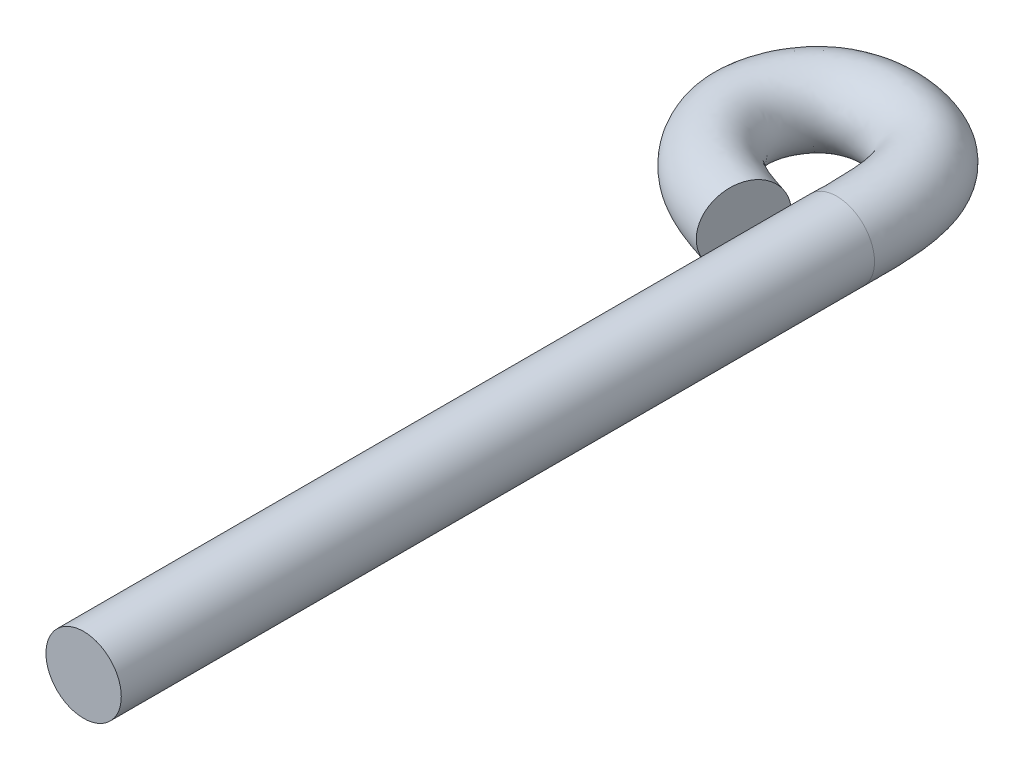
ISO-10303-21;
HEADER;
FILE_DESCRIPTION(('STEP AP214'),'2;1');
FILE_NAME('part.step','',(''),(''),'','','');
FILE_SCHEMA(('AUTOMOTIVE_DESIGN { 1 0 10303 214 1 1 1 1 }'));
ENDSEC;
DATA;
#1=APPLICATION_CONTEXT('core data for automotive mechanical design processes');
#2=APPLICATION_PROTOCOL_DEFINITION('international standard','automotive_design',2000,#1);
#3=PRODUCT_CONTEXT('',#1,'mechanical');
#4=PRODUCT('Part','Part','',(#3));
#5=PRODUCT_RELATED_PRODUCT_CATEGORY('part','',(#4));
#6=PRODUCT_DEFINITION_FORMATION('','',#4);
#7=PRODUCT_DEFINITION_CONTEXT('part definition',#1,'design');
#8=PRODUCT_DEFINITION('design','',#6,#7);
#9=PRODUCT_DEFINITION_SHAPE('','',#8);
#10=(LENGTH_UNIT() NAMED_UNIT(*) SI_UNIT(.MILLI.,.METRE.));
#11=(NAMED_UNIT(*) PLANE_ANGLE_UNIT() SI_UNIT($,.RADIAN.));
#12=(NAMED_UNIT(*) SI_UNIT($,.STERADIAN.) SOLID_ANGLE_UNIT());
#13=UNCERTAINTY_MEASURE_WITH_UNIT(LENGTH_MEASURE(1.E-05),#10,'distance_accuracy_value','');
#14=(GEOMETRIC_REPRESENTATION_CONTEXT(3) GLOBAL_UNCERTAINTY_ASSIGNED_CONTEXT((#13)) GLOBAL_UNIT_ASSIGNED_CONTEXT((#10,
#11,#12)) REPRESENTATION_CONTEXT('',''));
#15=CARTESIAN_POINT('',(0.,0.,0.));
#16=DIRECTION('',(0.,0.,1.));
#17=DIRECTION('',(1.,0.,0.));
#18=AXIS2_PLACEMENT_3D('',#15,#16,#17);
#19=CARTESIAN_POINT('',(0.,0.,0.));
#20=DIRECTION('',(0.,0.,1.));
#21=DIRECTION('',(1.,0.,0.));
#22=AXIS2_PLACEMENT_3D('',#19,#20,#21);
#23=PLANE('',#22);
#24=CARTESIAN_POINT('',(0.,0.,0.));
#25=DIRECTION('',(0.,0.,1.));
#26=DIRECTION('',(1.,0.,0.));
#27=AXIS2_PLACEMENT_3D('',#24,#25,#26);
#28=CIRCLE('',#27,1.1);
#29=CARTESIAN_POINT('',(1.1,0.,0.));
#30=VERTEX_POINT('',#29);
#31=EDGE_CURVE('E10',#30,#30,#28,.T.);
#32=ORIENTED_EDGE('',*,*,#31,.T.);
#33=EDGE_LOOP('',(#32));
#34=FACE_BOUND('',#33,.T.);
#35=ADVANCED_FACE('F360',(#34),#23,.T.);
#36=CARTESIAN_POINT('',(0.,0.,-25.1112698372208));
#37=DIRECTION('',(0.,0.,1.));
#38=DIRECTION('',(1.,0.,0.));
#39=AXIS2_PLACEMENT_3D('',#36,#37,#38);
#40=CYLINDRICAL_SURFACE('',#39,1.1);
#41=ORIENTED_EDGE('',*,*,#31,.F.);
#42=EDGE_LOOP('',(#41));
#43=FACE_BOUND('',#42,.T.);
#44=CARTESIAN_POINT('',(1.1,0.,-21.9939017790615));
#45=CARTESIAN_POINT('',(1.1,2.2,-21.9939017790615));
#46=CARTESIAN_POINT('',(-1.1,2.2,-22.0060982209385));
#47=CARTESIAN_POINT('',(-1.1,0.,-22.0060982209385));
#48=CARTESIAN_POINT('',(-1.1,-2.2,-22.0060982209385));
#49=CARTESIAN_POINT('',(1.1,-2.2,-21.9939017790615));
#50=CARTESIAN_POINT('',(1.1,0.,-21.9939017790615));
#51=(BOUNDED_CURVE() B_SPLINE_CURVE(3,(#44,#45,#46,#47,#48,#49,#50),.UNSPECIFIED.,.T.,
.F.) B_SPLINE_CURVE_WITH_KNOTS((4,3,4),(0.,0.5,1.),
.UNSPECIFIED.) CURVE() GEOMETRIC_REPRESENTATION_ITEM() RATIONAL_B_SPLINE_CURVE((1.,
0.333333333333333,0.333333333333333,1.,0.333333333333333,0.333333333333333,1.)) REPRESENTATION_ITEM(''));
#52=CARTESIAN_POINT('',(1.1,0.,-21.9939017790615));
#53=VERTEX_POINT('',#52);
#54=EDGE_CURVE('E371',#53,#53,#51,.T.);
#55=ORIENTED_EDGE('',*,*,#54,.T.);
#56=EDGE_LOOP('',(#55));
#57=FACE_BOUND('',#56,.T.);
#58=ADVANCED_FACE('F362',(#43,#57),#40,.T.);
#59=CARTESIAN_POINT('',(-1.39315186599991,0.,-22.055074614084));
#60=DIRECTION('',(0.951083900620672,0.,0.308932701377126));
#61=DIRECTION('',(0.308932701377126,0.,-0.951083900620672));
#62=AXIS2_PLACEMENT_3D('',#59,#60,#61);
#63=PLANE('',#62);
#64=CARTESIAN_POINT('',(-1.73297783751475,0.,-21.0088823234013));
#65=DIRECTION('',(0.951083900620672,0.,0.308932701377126));
#66=DIRECTION('',(0.308932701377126,0.,-0.951083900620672));
#67=AXIS2_PLACEMENT_3D('',#64,#65,#66);
#68=CIRCLE('',#67,1.1);
#69=CARTESIAN_POINT('',(-1.39315186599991,0.,-22.055074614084));
#70=VERTEX_POINT('',#69);
#71=EDGE_CURVE('E367',#70,#70,#68,.T.);
#72=ORIENTED_EDGE('',*,*,#71,.T.);
#73=EDGE_LOOP('',(#72));
#74=FACE_BOUND('',#73,.T.);
#75=ADVANCED_FACE('F387',(#74),#63,.T.);
#76=CARTESIAN_POINT('',(1.1,0.,-21.9939017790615));
#77=CARTESIAN_POINT('',(1.10248040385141,0.,-22.2176031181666));
#78=CARTESIAN_POINT('',(1.10758000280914,0.,-22.6667240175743));
#79=CARTESIAN_POINT('',(1.09071506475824,0.,-23.3772602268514));
#80=CARTESIAN_POINT('',(1.03318346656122,0.,-23.9519260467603));
#81=CARTESIAN_POINT('',(0.951777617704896,0.,-24.3708177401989));
#82=CARTESIAN_POINT('',(0.889286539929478,0.,-24.6204636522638));
#83=CARTESIAN_POINT('',(0.810087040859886,0.,-24.8705830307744));
#84=CARTESIAN_POINT('',(0.711243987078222,0.,-25.1201038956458));
#85=CARTESIAN_POINT('',(0.589726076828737,0.,-25.3671839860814));
#86=CARTESIAN_POINT('',(0.442711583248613,0.,-25.6089413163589));
#87=CARTESIAN_POINT('',(0.283240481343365,0.,-25.8212156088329));
#88=CARTESIAN_POINT('',(0.118665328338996,0.,-26.0029811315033));
#89=CARTESIAN_POINT('',(-0.0440043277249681,0.,-26.156013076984));
#90=CARTESIAN_POINT('',(-0.221628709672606,0.,-26.2974471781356));
#91=CARTESIAN_POINT('',(-0.407390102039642,0.,-26.4221578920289));
#92=CARTESIAN_POINT('',(-0.597896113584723,0.,-26.5307239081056));
#93=CARTESIAN_POINT('',(-0.804233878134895,0.,-26.6305065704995));
#94=CARTESIAN_POINT('',(-1.02600800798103,0.,-26.7195721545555));
#95=CARTESIAN_POINT('',(-1.26299175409,0.,-26.7962745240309));
#96=CARTESIAN_POINT('',(-1.50273221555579,0.,-26.8569132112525));
#97=CARTESIAN_POINT('',(-1.74734126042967,0.,-26.9025424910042));
#98=CARTESIAN_POINT('',(-1.99690171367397,0.,-26.9326387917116));
#99=CARTESIAN_POINT('',(-2.25067000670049,0.,-26.9463421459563));
#100=CARTESIAN_POINT('',(-2.50653787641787,0.,-26.9427955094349));
#101=CARTESIAN_POINT('',(-2.76373779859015,0.,-26.9211150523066));
#102=CARTESIAN_POINT('',(-3.0198541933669,0.,-26.8804704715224));
#103=CARTESIAN_POINT('',(-3.27378205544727,0.,-26.8200355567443));
#104=CARTESIAN_POINT('',(-3.52418743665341,0.,-26.7389350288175));
#105=CARTESIAN_POINT('',(-3.7709445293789,0.,-26.6354234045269));
#106=CARTESIAN_POINT('',(-3.99946039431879,0.,-26.5148207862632));
#107=CARTESIAN_POINT('',(-4.20893250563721,0.,-26.3800733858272));
#108=CARTESIAN_POINT('',(-4.39627610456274,0.,-26.2365438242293));
#109=CARTESIAN_POINT('',(-4.5688059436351,0.,-26.0814052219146));
#110=CARTESIAN_POINT('',(-4.72760903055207,0.,-25.9156263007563));
#111=CARTESIAN_POINT('',(-4.87269376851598,0.,-25.7406382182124));
#112=CARTESIAN_POINT('',(-5.0122655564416,0.,-25.5464683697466));
#113=CARTESIAN_POINT('',(-5.14357027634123,0.,-25.3323919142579));
#114=CARTESIAN_POINT('',(-5.26362875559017,0.,-25.0978687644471));
#115=CARTESIAN_POINT('',(-5.36540746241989,0.,-24.8551365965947));
#116=CARTESIAN_POINT('',(-5.44437340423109,0.,-24.6175667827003));
#117=CARTESIAN_POINT('',(-5.50313049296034,0.,-24.3870243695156));
#118=CARTESIAN_POINT('',(-5.54414972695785,0.,-24.165033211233));
#119=CARTESIAN_POINT('',(-5.57001074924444,0.,-23.9390405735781));
#120=CARTESIAN_POINT('',(-5.57980959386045,0.,-23.7096963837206));
#121=CARTESIAN_POINT('',(-5.57248485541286,0.,-23.4773178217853));
#122=CARTESIAN_POINT('',(-5.54534072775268,0.,-23.2312823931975));
#123=CARTESIAN_POINT('',(-5.49615039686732,0.,-22.9798629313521));
#124=CARTESIAN_POINT('',(-5.42336810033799,0.,-22.7249374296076));
#125=CARTESIAN_POINT('',(-5.33200307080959,0.,-22.4812054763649));
#126=CARTESIAN_POINT('',(-5.21441381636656,0.,-22.2278289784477));
#127=CARTESIAN_POINT('',(-5.06751128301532,0.,-21.9688939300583));
#128=CARTESIAN_POINT('',(-4.88921802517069,0.,-21.7088483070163));
#129=CARTESIAN_POINT('',(-4.69351201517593,0.,-21.4672809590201));
#130=CARTESIAN_POINT('',(-4.48258231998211,0.,-21.2439660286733));
#131=CARTESIAN_POINT('',(-4.25820351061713,0.,-21.0388763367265));
#132=CARTESIAN_POINT('',(-4.02176309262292,0.,-20.8520059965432));
#133=CARTESIAN_POINT('',(-3.77448776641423,0.,-20.6843187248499));
#134=CARTESIAN_POINT('',(-3.43749120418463,0.,-20.4877573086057));
#135=CARTESIAN_POINT('',(-3.01265995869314,0.,-20.2897011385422));
#136=CARTESIAN_POINT('',(-2.52336051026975,0.,-20.1089331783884));
#137=CARTESIAN_POINT('',(-2.21713624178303,0.,-20.0095723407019));
#138=CARTESIAN_POINT('',(-2.07280380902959,0.,-19.9626900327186));
#139=CARTESIAN_POINT('',(1.1,2.2,-21.9939017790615));
#140=CARTESIAN_POINT('',(1.10232825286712,2.2,-22.2038810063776));
#141=CARTESIAN_POINT('',(1.10764967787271,2.2,-22.6730078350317));
#142=CARTESIAN_POINT('',(1.0906967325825,2.2,-23.375606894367));
#143=CARTESIAN_POINT('',(1.03318486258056,2.2,-23.9520519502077));
#144=CARTESIAN_POINT('',(0.95177742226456,2.2,-24.3708001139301));
#145=CARTESIAN_POINT('',(0.889286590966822,2.2,-24.6204682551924));
#146=CARTESIAN_POINT('',(0.810087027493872,2.2,-24.8705818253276));
#147=CARTESIAN_POINT('',(0.711243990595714,2.2,-25.1201042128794));
#148=CARTESIAN_POINT('',(0.589726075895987,2.2,-25.3671839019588));
#149=CARTESIAN_POINT('',(0.442711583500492,2.2,-25.6089413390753));
#150=CARTESIAN_POINT('',(0.28324048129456,2.2,-25.8212156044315));
#151=CARTESIAN_POINT('',(0.118665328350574,2.2,-26.0029811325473));
#152=CARTESIAN_POINT('',(-0.0440043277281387,2.2,-26.1560130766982));
#153=CARTESIAN_POINT('',(-0.221628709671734,2.2,-26.2974471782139));
#154=CARTESIAN_POINT('',(-0.407390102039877,2.2,-26.4221578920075));
#155=CARTESIAN_POINT('',(-0.597896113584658,2.2,-26.5307239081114));
#156=CARTESIAN_POINT('',(-0.804233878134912,2.2,-26.6305065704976));
#157=CARTESIAN_POINT('',(-1.02600800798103,2.2,-26.719572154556));
#158=CARTESIAN_POINT('',(-1.26299175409,2.2,-26.7962745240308));
#159=CARTESIAN_POINT('',(-1.50273221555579,2.2,-26.8569132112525));
#160=CARTESIAN_POINT('',(-1.74734126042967,2.2,-26.9025424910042));
#161=CARTESIAN_POINT('',(-1.99690171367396,2.2,-26.9326387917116));
#162=CARTESIAN_POINT('',(-2.25067000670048,2.2,-26.9463421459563));
#163=CARTESIAN_POINT('',(-2.50653787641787,2.2,-26.9427955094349));
#164=CARTESIAN_POINT('',(-2.76373779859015,2.2,-26.9211150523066));
#165=CARTESIAN_POINT('',(-3.0198541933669,2.2,-26.8804704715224));
#166=CARTESIAN_POINT('',(-3.27378205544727,2.2,-26.8200355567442));
#167=CARTESIAN_POINT('',(-3.52418743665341,2.2,-26.7389350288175));
#168=CARTESIAN_POINT('',(-3.7709445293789,2.2,-26.6354234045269));
#169=CARTESIAN_POINT('',(-3.99946039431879,2.2,-26.5148207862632));
#170=CARTESIAN_POINT('',(-4.20893250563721,2.2,-26.3800733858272));
#171=CARTESIAN_POINT('',(-4.39627610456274,2.2,-26.2365438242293));
#172=CARTESIAN_POINT('',(-4.5688059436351,2.2,-26.0814052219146));
#173=CARTESIAN_POINT('',(-4.72760903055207,2.2,-25.9156263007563));
#174=CARTESIAN_POINT('',(-4.87269376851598,2.2,-25.7406382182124));
#175=CARTESIAN_POINT('',(-5.0122655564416,2.2,-25.5464683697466));
#176=CARTESIAN_POINT('',(-5.14357027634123,2.2,-25.3323919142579));
#177=CARTESIAN_POINT('',(-5.26362875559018,2.2,-25.0978687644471));
#178=CARTESIAN_POINT('',(-5.36540746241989,2.2,-24.8551365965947));
#179=CARTESIAN_POINT('',(-5.4443734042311,2.2,-24.6175667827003));
#180=CARTESIAN_POINT('',(-5.50313049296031,2.2,-24.3870243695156));
#181=CARTESIAN_POINT('',(-5.54414972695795,2.2,-24.165033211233));
#182=CARTESIAN_POINT('',(-5.57001074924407,2.2,-23.939040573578));
#183=CARTESIAN_POINT('',(-5.57980959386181,2.2,-23.7096963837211));
#184=CARTESIAN_POINT('',(-5.57248485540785,2.2,-23.4773178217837));
#185=CARTESIAN_POINT('',(-5.54534072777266,2.2,-23.231282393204));
#186=CARTESIAN_POINT('',(-5.49615039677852,2.2,-22.9798629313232));
#187=CARTESIAN_POINT('',(-5.42336810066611,2.2,-22.7249374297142));
#188=CARTESIAN_POINT('',(-5.33200306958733,2.2,-22.4812054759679));
#189=CARTESIAN_POINT('',(-5.21441382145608,2.2,-22.2278289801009));
#190=CARTESIAN_POINT('',(-5.06751125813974,2.2,-21.9688939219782));
#191=CARTESIAN_POINT('',(-4.88921811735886,2.2,-21.708848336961));
#192=CARTESIAN_POINT('',(-4.69351167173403,2.2,-21.4672808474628));
#193=CARTESIAN_POINT('',(-4.48258359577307,2.2,-21.243966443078));
#194=CARTESIAN_POINT('',(-4.2581987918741,2.2,-21.0388748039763));
#195=CARTESIAN_POINT('',(-4.02178045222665,2.2,-20.8520116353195));
#196=CARTESIAN_POINT('',(-3.77442425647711,2.2,-20.6842980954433));
#197=CARTESIAN_POINT('',(-3.43782925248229,2.2,-20.4878671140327));
#198=CARTESIAN_POINT('',(-3.00985415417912,2.2,-20.2887897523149));
#199=CARTESIAN_POINT('',(-2.53340793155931,2.2,-20.1121967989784));
#200=CARTESIAN_POINT('',(-2.19576259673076,2.2,-20.0026297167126));
#201=CARTESIAN_POINT('',(-2.07280380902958,2.2,-19.9626900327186));
#202=CARTESIAN_POINT('',(-1.1,2.2,-22.0060982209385));
#203=CARTESIAN_POINT('',(-1.09767174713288,2.2,-22.2160774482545));
#204=CARTESIAN_POINT('',(-1.09267561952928,2.2,-22.6776879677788));
#205=CARTESIAN_POINT('',(-1.10789755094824,2.2,-23.2538774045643));
#206=CARTESIAN_POINT('',(-1.15033253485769,2.2,-23.655961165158));
#207=CARTESIAN_POINT('',(-1.19738312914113,2.2,-23.8957061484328));
#208=CARTESIAN_POINT('',(-1.22950858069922,2.2,-24.0231686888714));
#209=CARTESIAN_POINT('',(-1.26513206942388,2.2,-24.1347277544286));
#210=CARTESIAN_POINT('',(-1.30323198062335,2.2,-24.2300540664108));
#211=CARTESIAN_POINT('',(-1.34268641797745,2.2,-24.3095184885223));
#212=CARTESIAN_POINT('',(-1.38257056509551,2.2,-24.3745047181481));
#213=CARTESIAN_POINT('',(-1.41924952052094,2.2,-24.4229468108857));
#214=CARTESIAN_POINT('',(-1.45331453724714,2.2,-24.4605094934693));
#215=CARTESIAN_POINT('',(-1.48600583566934,2.2,-24.4911823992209));
#216=CARTESIAN_POINT('',(-1.52084976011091,2.2,-24.5190742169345));
#217=CARTESIAN_POINT('',(-1.56558021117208,2.2,-24.5493827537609));
#218=CARTESIAN_POINT('',(-1.62158650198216,2.2,-24.5815175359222));
#219=CARTESIAN_POINT('',(-1.69108614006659,2.2,-24.615288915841));
#220=CARTESIAN_POINT('',(-1.77462148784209,2.2,-24.6490098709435));
#221=CARTESIAN_POINT('',(-1.87135876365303,2.2,-24.6804416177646));
#222=CARTESIAN_POINT('',(-1.97460059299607,2.2,-24.7066071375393));
#223=CARTESIAN_POINT('',(-2.08113319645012,2.2,-24.7264761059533));
#224=CARTESIAN_POINT('',(-2.18847571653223,2.2,-24.7393880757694));
#225=CARTESIAN_POINT('',(-2.29532058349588,2.2,-24.7451097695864));
#226=CARTESIAN_POINT('',(-2.3994185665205,2.2,-24.7435939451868));
#227=CARTESIAN_POINT('',(-2.49932927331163,2.2,-24.7350782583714));
#228=CARTESIAN_POINT('',(-2.59316752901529,2.2,-24.7200697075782));
#229=CARTESIAN_POINT('',(-2.67994888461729,2.2,-24.699285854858));
#230=CARTESIAN_POINT('',(-2.75905364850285,2.2,-24.673512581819));
#231=CARTESIAN_POINT('',(-2.83052328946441,2.2,-24.6433873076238));
#232=CARTESIAN_POINT('',(-2.89138829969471,2.2,-24.6110839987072));
#233=CARTESIAN_POINT('',(-2.94244667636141,2.2,-24.5781776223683));
#234=CARTESIAN_POINT('',(-2.98826555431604,2.2,-24.5431575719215));
#235=CARTESIAN_POINT('',(-3.03607354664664,2.2,-24.500372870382));
#236=CARTESIAN_POINT('',(-3.08350506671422,2.2,-24.450967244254));
#237=CARTESIAN_POINT('',(-3.1299562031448,2.2,-24.3950724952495));
#238=CARTESIAN_POINT('',(-3.17703380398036,2.2,-24.3296834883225));
#239=CARTESIAN_POINT('',(-3.22324153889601,2.2,-24.2544695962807));
#240=CARTESIAN_POINT('',(-3.26661841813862,2.2,-24.1698061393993));
#241=CARTESIAN_POINT('',(-3.30369000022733,2.2,-24.0813944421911));
#242=CARTESIAN_POINT('',(-3.33216062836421,2.2,-23.9956375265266));
#243=CARTESIAN_POINT('',(-3.35280263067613,2.2,-23.9144796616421));
#244=CARTESIAN_POINT('',(-3.36667120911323,2.2,-23.8391062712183));
#245=CARTESIAN_POINT('',(-3.37494959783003,2.2,-23.7661670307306));
#246=CARTESIAN_POINT('',(-3.37782156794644,2.2,-23.6965852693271));
#247=CARTESIAN_POINT('',(-3.3756847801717,2.2,-23.6320171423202));
#248=CARTESIAN_POINT('',(-3.36855447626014,2.2,-23.5673341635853));
#249=CARTESIAN_POINT('',(-3.35453225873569,2.2,-23.4947118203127));
#250=CARTESIAN_POINT('',(-3.33197993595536,2.2,-23.4152905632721));
#251=CARTESIAN_POINT('',(-3.30116165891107,2.2,-23.3326566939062));
#252=CARTESIAN_POINT('',(-3.25825676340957,2.2,-23.2398814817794));
#253=CARTESIAN_POINT('',(-3.2002945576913,2.2,-23.1372895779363));
#254=CARTESIAN_POINT('',(-3.12461358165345,2.2,-23.0265995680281));
#255=CARTESIAN_POINT('',(-3.03681476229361,2.2,-22.9180293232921));
#256=CARTESIAN_POINT('',(-2.93856940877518,2.2,-22.8139041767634));
#257=CARTESIAN_POINT('',(-2.83189459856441,2.2,-22.7163592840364));
#258=CARTESIAN_POINT('',(-2.71945282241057,2.2,-22.6275430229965));
#259=CARTESIAN_POINT('',(-2.603223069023,2.2,-22.5486551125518));
#260=CARTESIAN_POINT('',(-2.42948458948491,2.2,-22.4467783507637));
#261=CARTESIAN_POINT('',(-2.17334074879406,2.2,-22.3262057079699));
#262=CARTESIAN_POINT('',(-1.82478521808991,2.2,-22.1954716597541));
#263=CARTESIAN_POINT('',(-1.51611065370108,2.2,-22.095014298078));
#264=CARTESIAN_POINT('',(-1.39315186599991,2.2,-22.055074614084));
#265=CARTESIAN_POINT('',(-1.1,0.,-22.0060982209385));
#266=CARTESIAN_POINT('',(-1.09759567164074,0.,-22.222938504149));
#267=CARTESIAN_POINT('',(-1.09271045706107,0.,-22.6745460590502));
#268=CARTESIAN_POINT('',(-1.10788838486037,0.,-23.2547040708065));
#269=CARTESIAN_POINT('',(-1.15033323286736,0.,-23.6558982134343));
#270=CARTESIAN_POINT('',(-1.19738303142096,0.,-23.8957149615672));
#271=CARTESIAN_POINT('',(-1.2295086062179,0.,-24.0231663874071));
#272=CARTESIAN_POINT('',(-1.26513206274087,0.,-24.1347283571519));
#273=CARTESIAN_POINT('',(-1.3032319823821,0.,-24.230053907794));
#274=CARTESIAN_POINT('',(-1.34268641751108,0.,-24.3095185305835));
#275=CARTESIAN_POINT('',(-1.38257056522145,0.,-24.3745047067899));
#276=CARTESIAN_POINT('',(-1.41924952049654,0.,-24.4229468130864));
#277=CARTESIAN_POINT('',(-1.45331453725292,0.,-24.4605094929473));
#278=CARTESIAN_POINT('',(-1.48600583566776,0.,-24.4911823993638));
#279=CARTESIAN_POINT('',(-1.52084976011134,0.,-24.5190742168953));
#280=CARTESIAN_POINT('',(-1.56558021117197,0.,-24.5493827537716));
#281=CARTESIAN_POINT('',(-1.6215865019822,0.,-24.5815175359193));
#282=CARTESIAN_POINT('',(-1.69108614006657,0.,-24.615288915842));
#283=CARTESIAN_POINT('',(-1.7746214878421,0.,-24.6490098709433));
#284=CARTESIAN_POINT('',(-1.87135876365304,0.,-24.6804416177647));
#285=CARTESIAN_POINT('',(-1.97460059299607,0.,-24.7066071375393));
#286=CARTESIAN_POINT('',(-2.08113319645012,0.,-24.7264761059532));
#287=CARTESIAN_POINT('',(-2.18847571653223,0.,-24.7393880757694));
#288=CARTESIAN_POINT('',(-2.29532058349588,0.,-24.7451097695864));
#289=CARTESIAN_POINT('',(-2.3994185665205,0.,-24.7435939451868));
#290=CARTESIAN_POINT('',(-2.49932927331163,0.,-24.7350782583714));
#291=CARTESIAN_POINT('',(-2.59316752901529,0.,-24.7200697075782));
#292=CARTESIAN_POINT('',(-2.67994888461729,0.,-24.699285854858));
#293=CARTESIAN_POINT('',(-2.75905364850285,0.,-24.673512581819));
#294=CARTESIAN_POINT('',(-2.83052328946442,0.,-24.6433873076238));
#295=CARTESIAN_POINT('',(-2.8913882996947,0.,-24.6110839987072));
#296=CARTESIAN_POINT('',(-2.94244667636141,0.,-24.5781776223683));
#297=CARTESIAN_POINT('',(-2.98826555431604,0.,-24.5431575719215));
#298=CARTESIAN_POINT('',(-3.03607354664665,0.,-24.500372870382));
#299=CARTESIAN_POINT('',(-3.08350506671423,0.,-24.450967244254));
#300=CARTESIAN_POINT('',(-3.1299562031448,0.,-24.3950724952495));
#301=CARTESIAN_POINT('',(-3.17703380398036,0.,-24.3296834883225));
#302=CARTESIAN_POINT('',(-3.22324153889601,0.,-24.2544695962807));
#303=CARTESIAN_POINT('',(-3.26661841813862,0.,-24.1698061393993));
#304=CARTESIAN_POINT('',(-3.30369000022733,0.,-24.0813944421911));
#305=CARTESIAN_POINT('',(-3.33216062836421,0.,-23.9956375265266));
#306=CARTESIAN_POINT('',(-3.35280263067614,0.,-23.9144796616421));
#307=CARTESIAN_POINT('',(-3.36667120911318,0.,-23.8391062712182));
#308=CARTESIAN_POINT('',(-3.37494959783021,0.,-23.7661670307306));
#309=CARTESIAN_POINT('',(-3.37782156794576,0.,-23.6965852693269));
#310=CARTESIAN_POINT('',(-3.37568478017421,0.,-23.632017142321));
#311=CARTESIAN_POINT('',(-3.36855447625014,0.,-23.5673341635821));
#312=CARTESIAN_POINT('',(-3.35453225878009,0.,-23.4947118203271));
#313=CARTESIAN_POINT('',(-3.3319799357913,0.,-23.4152905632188));
#314=CARTESIAN_POINT('',(-3.3011616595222,0.,-23.3326566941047));
#315=CARTESIAN_POINT('',(-3.25825676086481,0.,-23.2398814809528));
#316=CARTESIAN_POINT('',(-3.20029457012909,0.,-23.1372895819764));
#317=CARTESIAN_POINT('',(-3.12461353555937,0.,-23.0265995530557));
#318=CARTESIAN_POINT('',(-3.03681493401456,0.,-22.9180293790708));
#319=CARTESIAN_POINT('',(-2.9385687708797,0.,-22.8139039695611));
#320=CARTESIAN_POINT('',(-2.83189695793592,0.,-22.7163600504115));
#321=CARTESIAN_POINT('',(-2.7194441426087,0.,-22.6275402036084));
#322=CARTESIAN_POINT('',(-2.60325482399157,0.,-22.5486654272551));
#323=CARTESIAN_POINT('',(-2.42931556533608,0.,-22.4467234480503));
#324=CARTESIAN_POINT('',(-2.17474365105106,0.,-22.3266614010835));
#325=CARTESIAN_POINT('',(-1.81976150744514,0.,-22.1938398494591));
#326=CARTESIAN_POINT('',(-1.52679747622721,0.,-22.0984856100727));
#327=CARTESIAN_POINT('',(-1.39315186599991,0.,-22.055074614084));
#328=CARTESIAN_POINT('',(-1.1,-2.2,-22.0060982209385));
#329=CARTESIAN_POINT('',(-1.09751959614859,-2.2,-22.2297995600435));
#330=CARTESIAN_POINT('',(-1.09274529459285,-2.2,-22.6714041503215));
#331=CARTESIAN_POINT('',(-1.1078792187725,-2.2,-23.2555307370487));
#332=CARTESIAN_POINT('',(-1.15033393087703,-2.2,-23.6558352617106));
#333=CARTESIAN_POINT('',(-1.19738293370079,-2.2,-23.8957237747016));
#334=CARTESIAN_POINT('',(-1.22950863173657,-2.2,-24.0231640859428));
#335=CARTESIAN_POINT('',(-1.26513205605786,-2.2,-24.1347289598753));
#336=CARTESIAN_POINT('',(-1.30323198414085,-2.2,-24.2300537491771));
#337=CARTESIAN_POINT('',(-1.3426864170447,-2.2,-24.3095185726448));
#338=CARTESIAN_POINT('',(-1.38257056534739,-2.2,-24.3745046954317));
#339=CARTESIAN_POINT('',(-1.41924952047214,-2.2,-24.4229468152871));
#340=CARTESIAN_POINT('',(-1.45331453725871,-2.2,-24.4605094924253));
#341=CARTESIAN_POINT('',(-1.48600583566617,-2.2,-24.4911823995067));
#342=CARTESIAN_POINT('',(-1.52084976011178,-2.2,-24.5190742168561));
#343=CARTESIAN_POINT('',(-1.56558021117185,-2.2,-24.5493827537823));
#344=CARTESIAN_POINT('',(-1.62158650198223,-2.2,-24.5815175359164));
#345=CARTESIAN_POINT('',(-1.69108614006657,-2.2,-24.6152889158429));
#346=CARTESIAN_POINT('',(-1.77462148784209,-2.2,-24.649009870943));
#347=CARTESIAN_POINT('',(-1.87135876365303,-2.2,-24.6804416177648));
#348=CARTESIAN_POINT('',(-1.97460059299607,-2.2,-24.7066071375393));
#349=CARTESIAN_POINT('',(-2.08113319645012,-2.2,-24.7264761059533));
#350=CARTESIAN_POINT('',(-2.18847571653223,-2.2,-24.7393880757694));
#351=CARTESIAN_POINT('',(-2.29532058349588,-2.2,-24.7451097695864));
#352=CARTESIAN_POINT('',(-2.3994185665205,-2.2,-24.7435939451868));
#353=CARTESIAN_POINT('',(-2.49932927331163,-2.2,-24.7350782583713));
#354=CARTESIAN_POINT('',(-2.59316752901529,-2.2,-24.7200697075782));
#355=CARTESIAN_POINT('',(-2.67994888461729,-2.2,-24.699285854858));
#356=CARTESIAN_POINT('',(-2.75905364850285,-2.2,-24.673512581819));
#357=CARTESIAN_POINT('',(-2.83052328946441,-2.2,-24.6433873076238));
#358=CARTESIAN_POINT('',(-2.89138829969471,-2.2,-24.6110839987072));
#359=CARTESIAN_POINT('',(-2.94244667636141,-2.2,-24.5781776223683));
#360=CARTESIAN_POINT('',(-2.98826555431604,-2.2,-24.5431575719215));
#361=CARTESIAN_POINT('',(-3.03607354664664,-2.2,-24.500372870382));
#362=CARTESIAN_POINT('',(-3.08350506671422,-2.2,-24.450967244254));
#363=CARTESIAN_POINT('',(-3.1299562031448,-2.2,-24.3950724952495));
#364=CARTESIAN_POINT('',(-3.17703380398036,-2.2,-24.3296834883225));
#365=CARTESIAN_POINT('',(-3.22324153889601,-2.2,-24.2544695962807));
#366=CARTESIAN_POINT('',(-3.26661841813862,-2.2,-24.1698061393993));
#367=CARTESIAN_POINT('',(-3.30369000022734,-2.2,-24.0813944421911));
#368=CARTESIAN_POINT('',(-3.33216062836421,-2.2,-23.9956375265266));
#369=CARTESIAN_POINT('',(-3.35280263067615,-2.2,-23.9144796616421));
#370=CARTESIAN_POINT('',(-3.36667120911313,-2.2,-23.8391062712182));
#371=CARTESIAN_POINT('',(-3.37494959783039,-2.2,-23.7661670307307));
#372=CARTESIAN_POINT('',(-3.37782156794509,-2.2,-23.6965852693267));
#373=CARTESIAN_POINT('',(-3.37568478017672,-2.2,-23.6320171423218));
#374=CARTESIAN_POINT('',(-3.36855447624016,-2.2,-23.5673341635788));
#375=CARTESIAN_POINT('',(-3.35453225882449,-2.2,-23.4947118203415));
#376=CARTESIAN_POINT('',(-3.33197993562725,-2.2,-23.4152905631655));
#377=CARTESIAN_POINT('',(-3.30116166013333,-2.2,-23.3326566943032));
#378=CARTESIAN_POINT('',(-3.25825675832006,-2.2,-23.2398814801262));
#379=CARTESIAN_POINT('',(-3.20029458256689,-2.2,-23.1372895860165));
#380=CARTESIAN_POINT('',(-3.12461348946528,-2.2,-23.0265995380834));
#381=CARTESIAN_POINT('',(-3.03681510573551,-2.2,-22.9180294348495));
#382=CARTESIAN_POINT('',(-2.93856813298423,-2.2,-22.8139037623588));
#383=CARTESIAN_POINT('',(-2.83189931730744,-2.2,-22.7163608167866));
#384=CARTESIAN_POINT('',(-2.71943546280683,-2.2,-22.6275373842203));
#385=CARTESIAN_POINT('',(-2.60328657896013,-2.2,-22.5486757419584));
#386=CARTESIAN_POINT('',(-2.42914654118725,-2.2,-22.4466685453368));
#387=CARTESIAN_POINT('',(-2.17614655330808,-2.2,-22.3271170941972));
#388=CARTESIAN_POINT('',(-1.81473779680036,-2.2,-22.1922080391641));
#389=CARTESIAN_POINT('',(-1.53748429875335,-2.2,-22.1019569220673));
#390=CARTESIAN_POINT('',(-1.39315186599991,-2.2,-22.055074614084));
#391=CARTESIAN_POINT('',(1.1,-2.2,-21.9939017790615));
#392=CARTESIAN_POINT('',(1.10263255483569,-2.2,-22.2313252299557));
#393=CARTESIAN_POINT('',(1.10751032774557,-2.2,-22.660440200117));
#394=CARTESIAN_POINT('',(1.09073339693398,-2.2,-23.3789135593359));
#395=CARTESIAN_POINT('',(1.03318207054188,-2.2,-23.9518001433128));
#396=CARTESIAN_POINT('',(0.951777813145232,-2.2,-24.3708353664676));
#397=CARTESIAN_POINT('',(0.889286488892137,-2.2,-24.6204590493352));
#398=CARTESIAN_POINT('',(0.810087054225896,-2.2,-24.8705842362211));
#399=CARTESIAN_POINT('',(0.711243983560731,-2.2,-25.1201035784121));
#400=CARTESIAN_POINT('',(0.589726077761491,-2.2,-25.3671840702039));
#401=CARTESIAN_POINT('',(0.442711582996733,-2.2,-25.6089412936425));
#402=CARTESIAN_POINT('',(0.283240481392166,-2.2,-25.8212156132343));
#403=CARTESIAN_POINT('',(0.118665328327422,-2.2,-26.0029811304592));
#404=CARTESIAN_POINT('',(-0.0440043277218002,-2.2,-26.1560130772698));
#405=CARTESIAN_POINT('',(-0.221628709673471,-2.2,-26.2974471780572));
#406=CARTESIAN_POINT('',(-0.407390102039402,-2.2,-26.4221578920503));
#407=CARTESIAN_POINT('',(-0.597896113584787,-2.2,-26.5307239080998));
#408=CARTESIAN_POINT('',(-0.80423387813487,-2.2,-26.6305065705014));
#409=CARTESIAN_POINT('',(-1.02600800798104,-2.2,-26.7195721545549));
#410=CARTESIAN_POINT('',(-1.26299175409,-2.2,-26.7962745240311));
#411=CARTESIAN_POINT('',(-1.5027322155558,-2.2,-26.8569132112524));
#412=CARTESIAN_POINT('',(-1.74734126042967,-2.2,-26.9025424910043));
#413=CARTESIAN_POINT('',(-1.99690171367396,-2.2,-26.9326387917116));
#414=CARTESIAN_POINT('',(-2.25067000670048,-2.2,-26.9463421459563));
#415=CARTESIAN_POINT('',(-2.50653787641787,-2.2,-26.9427955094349));
#416=CARTESIAN_POINT('',(-2.76373779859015,-2.2,-26.9211150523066));
#417=CARTESIAN_POINT('',(-3.0198541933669,-2.2,-26.8804704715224));
#418=CARTESIAN_POINT('',(-3.27378205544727,-2.2,-26.8200355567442));
#419=CARTESIAN_POINT('',(-3.52418743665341,-2.2,-26.7389350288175));
#420=CARTESIAN_POINT('',(-3.7709445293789,-2.2,-26.6354234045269));
#421=CARTESIAN_POINT('',(-3.99946039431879,-2.2,-26.5148207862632));
#422=CARTESIAN_POINT('',(-4.20893250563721,-2.2,-26.3800733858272));
#423=CARTESIAN_POINT('',(-4.39627610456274,-2.2,-26.2365438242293));
#424=CARTESIAN_POINT('',(-4.5688059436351,-2.2,-26.0814052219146));
#425=CARTESIAN_POINT('',(-4.72760903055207,-2.2,-25.9156263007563));
#426=CARTESIAN_POINT('',(-4.87269376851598,-2.2,-25.7406382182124));
#427=CARTESIAN_POINT('',(-5.0122655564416,-2.2,-25.5464683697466));
#428=CARTESIAN_POINT('',(-5.14357027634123,-2.2,-25.3323919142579));
#429=CARTESIAN_POINT('',(-5.26362875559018,-2.2,-25.0978687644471));
#430=CARTESIAN_POINT('',(-5.36540746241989,-2.2,-24.8551365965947));
#431=CARTESIAN_POINT('',(-5.44437340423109,-2.2,-24.6175667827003));
#432=CARTESIAN_POINT('',(-5.50313049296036,-2.2,-24.3870243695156));
#433=CARTESIAN_POINT('',(-5.54414972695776,-2.2,-24.165033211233));
#434=CARTESIAN_POINT('',(-5.5700107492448,-2.2,-23.9390405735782));
#435=CARTESIAN_POINT('',(-5.57980959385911,-2.2,-23.7096963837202));
#436=CARTESIAN_POINT('',(-5.57248485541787,-2.2,-23.4773178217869));
#437=CARTESIAN_POINT('',(-5.5453407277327,-2.2,-23.231282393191));
#438=CARTESIAN_POINT('',(-5.49615039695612,-2.2,-22.9798629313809));
#439=CARTESIAN_POINT('',(-5.42336810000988,-2.2,-22.7249374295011));
#440=CARTESIAN_POINT('',(-5.33200307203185,-2.2,-22.4812054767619));
#441=CARTESIAN_POINT('',(-5.21441381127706,-2.2,-22.2278289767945));
#442=CARTESIAN_POINT('',(-5.06751130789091,-2.2,-21.9688939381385));
#443=CARTESIAN_POINT('',(-4.88921793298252,-2.2,-21.7088482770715));
#444=CARTESIAN_POINT('',(-4.69351235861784,-2.2,-21.4672810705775));
#445=CARTESIAN_POINT('',(-4.48258104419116,-2.2,-21.2439656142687));
#446=CARTESIAN_POINT('',(-4.25820822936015,-2.2,-21.0388778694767));
#447=CARTESIAN_POINT('',(-4.02174573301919,-2.2,-20.852000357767));
#448=CARTESIAN_POINT('',(-3.77455127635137,-2.2,-20.6843393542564));
#449=CARTESIAN_POINT('',(-3.43715315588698,-2.2,-20.4876475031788));
#450=CARTESIAN_POINT('',(-3.01546576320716,-2.2,-20.2906125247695));
#451=CARTESIAN_POINT('',(-2.5133130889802,-2.2,-20.1056695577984));
#452=CARTESIAN_POINT('',(-2.2385098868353,-2.2,-20.0165149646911));
#453=CARTESIAN_POINT('',(-2.07280380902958,-2.2,-19.9626900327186));
#454=CARTESIAN_POINT('',(1.1,0.,-21.9939017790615));
#455=CARTESIAN_POINT('',(1.10248040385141,0.,-22.2176031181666));
#456=CARTESIAN_POINT('',(1.10758000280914,0.,-22.6667240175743));
#457=CARTESIAN_POINT('',(1.09071506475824,0.,-23.3772602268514));
#458=CARTESIAN_POINT('',(1.03318346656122,0.,-23.9519260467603));
#459=CARTESIAN_POINT('',(0.951777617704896,0.,-24.3708177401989));
#460=CARTESIAN_POINT('',(0.889286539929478,0.,-24.6204636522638));
#461=CARTESIAN_POINT('',(0.810087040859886,0.,-24.8705830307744));
#462=CARTESIAN_POINT('',(0.711243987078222,0.,-25.1201038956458));
#463=CARTESIAN_POINT('',(0.589726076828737,0.,-25.3671839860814));
#464=CARTESIAN_POINT('',(0.442711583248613,0.,-25.6089413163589));
#465=CARTESIAN_POINT('',(0.283240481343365,0.,-25.8212156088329));
#466=CARTESIAN_POINT('',(0.118665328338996,0.,-26.0029811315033));
#467=CARTESIAN_POINT('',(-0.0440043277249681,0.,-26.156013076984));
#468=CARTESIAN_POINT('',(-0.221628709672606,0.,-26.2974471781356));
#469=CARTESIAN_POINT('',(-0.407390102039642,0.,-26.4221578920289));
#470=CARTESIAN_POINT('',(-0.597896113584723,0.,-26.5307239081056));
#471=CARTESIAN_POINT('',(-0.804233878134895,0.,-26.6305065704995));
#472=CARTESIAN_POINT('',(-1.02600800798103,0.,-26.7195721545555));
#473=CARTESIAN_POINT('',(-1.26299175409,0.,-26.7962745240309));
#474=CARTESIAN_POINT('',(-1.50273221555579,0.,-26.8569132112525));
#475=CARTESIAN_POINT('',(-1.74734126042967,0.,-26.9025424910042));
#476=CARTESIAN_POINT('',(-1.99690171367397,0.,-26.9326387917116));
#477=CARTESIAN_POINT('',(-2.25067000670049,0.,-26.9463421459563));
#478=CARTESIAN_POINT('',(-2.50653787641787,0.,-26.9427955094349));
#479=CARTESIAN_POINT('',(-2.76373779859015,0.,-26.9211150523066));
#480=CARTESIAN_POINT('',(-3.0198541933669,0.,-26.8804704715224));
#481=CARTESIAN_POINT('',(-3.27378205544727,0.,-26.8200355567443));
#482=CARTESIAN_POINT('',(-3.52418743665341,0.,-26.7389350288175));
#483=CARTESIAN_POINT('',(-3.7709445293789,0.,-26.6354234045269));
#484=CARTESIAN_POINT('',(-3.99946039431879,0.,-26.5148207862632));
#485=CARTESIAN_POINT('',(-4.20893250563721,0.,-26.3800733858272));
#486=CARTESIAN_POINT('',(-4.39627610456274,0.,-26.2365438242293));
#487=CARTESIAN_POINT('',(-4.5688059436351,0.,-26.0814052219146));
#488=CARTESIAN_POINT('',(-4.72760903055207,0.,-25.9156263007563));
#489=CARTESIAN_POINT('',(-4.87269376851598,0.,-25.7406382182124));
#490=CARTESIAN_POINT('',(-5.0122655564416,0.,-25.5464683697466));
#491=CARTESIAN_POINT('',(-5.14357027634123,0.,-25.3323919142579));
#492=CARTESIAN_POINT('',(-5.26362875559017,0.,-25.0978687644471));
#493=CARTESIAN_POINT('',(-5.36540746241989,0.,-24.8551365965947));
#494=CARTESIAN_POINT('',(-5.44437340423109,0.,-24.6175667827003));
#495=CARTESIAN_POINT('',(-5.50313049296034,0.,-24.3870243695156));
#496=CARTESIAN_POINT('',(-5.54414972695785,0.,-24.165033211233));
#497=CARTESIAN_POINT('',(-5.57001074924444,0.,-23.9390405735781));
#498=CARTESIAN_POINT('',(-5.57980959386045,0.,-23.7096963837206));
#499=CARTESIAN_POINT('',(-5.57248485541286,0.,-23.4773178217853));
#500=CARTESIAN_POINT('',(-5.54534072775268,0.,-23.2312823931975));
#501=CARTESIAN_POINT('',(-5.49615039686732,0.,-22.9798629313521));
#502=CARTESIAN_POINT('',(-5.42336810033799,0.,-22.7249374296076));
#503=CARTESIAN_POINT('',(-5.33200307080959,0.,-22.4812054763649));
#504=CARTESIAN_POINT('',(-5.21441381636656,0.,-22.2278289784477));
#505=CARTESIAN_POINT('',(-5.06751128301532,0.,-21.9688939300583));
#506=CARTESIAN_POINT('',(-4.88921802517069,0.,-21.7088483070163));
#507=CARTESIAN_POINT('',(-4.69351201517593,0.,-21.4672809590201));
#508=CARTESIAN_POINT('',(-4.48258231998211,0.,-21.2439660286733));
#509=CARTESIAN_POINT('',(-4.25820351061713,0.,-21.0388763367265));
#510=CARTESIAN_POINT('',(-4.02176309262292,0.,-20.8520059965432));
#511=CARTESIAN_POINT('',(-3.77448776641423,0.,-20.6843187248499));
#512=CARTESIAN_POINT('',(-3.43749120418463,0.,-20.4877573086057));
#513=CARTESIAN_POINT('',(-3.01265995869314,0.,-20.2897011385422));
#514=CARTESIAN_POINT('',(-2.52336051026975,0.,-20.1089331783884));
#515=CARTESIAN_POINT('',(-2.21713624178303,0.,-20.0095723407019));
#516=CARTESIAN_POINT('',(-2.07280380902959,0.,-19.9626900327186));
#517=(BOUNDED_SURFACE() B_SPLINE_SURFACE(3,3,((#76,#77,#78,#79,#80,#81,#82,#83,#84,#85,#86,#87,
#88,#89,#90,#91,#92,#93,#94,#95,#96,#97,#98,#99,#100,#101,#102,#103,#104,#105,#106,#107,#108,
#109,#110,#111,#112,#113,#114,#115,#116,#117,#118,#119,#120,#121,#122,#123,#124,#125,#126,#127,
#128,#129,#130,#131,#132,#133,#134,#135,#136,#137,#138),(#139,#140,#141,#142,#143,#144,#145,
#146,#147,#148,#149,#150,#151,#152,#153,#154,#155,#156,#157,#158,#159,#160,#161,#162,#163,#164,
#165,#166,#167,#168,#169,#170,#171,#172,#173,#174,#175,#176,#177,#178,#179,#180,#181,#182,#183,
#184,#185,#186,#187,#188,#189,#190,#191,#192,#193,#194,#195,#196,#197,#198,#199,#200,#201),
(#202,#203,#204,#205,#206,#207,#208,#209,#210,#211,#212,#213,#214,#215,#216,#217,#218,#219,#220,
#221,#222,#223,#224,#225,#226,#227,#228,#229,#230,#231,#232,#233,#234,#235,#236,#237,#238,#239,
#240,#241,#242,#243,#244,#245,#246,#247,#248,#249,#250,#251,#252,#253,#254,#255,#256,#257,#258,
#259,#260,#261,#262,#263,#264),(#265,#266,#267,#268,#269,#270,#271,#272,#273,#274,#275,#276,
#277,#278,#279,#280,#281,#282,#283,#284,#285,#286,#287,#288,#289,#290,#291,#292,#293,#294,#295,
#296,#297,#298,#299,#300,#301,#302,#303,#304,#305,#306,#307,#308,#309,#310,#311,#312,#313,#314,
#315,#316,#317,#318,#319,#320,#321,#322,#323,#324,#325,#326,#327),(#328,#329,#330,#331,#332,
#333,#334,#335,#336,#337,#338,#339,#340,#341,#342,#343,#344,#345,#346,#347,#348,#349,#350,#351,
#352,#353,#354,#355,#356,#357,#358,#359,#360,#361,#362,#363,#364,#365,#366,#367,#368,#369,#370,
#371,#372,#373,#374,#375,#376,#377,#378,#379,#380,#381,#382,#383,#384,#385,#386,#387,#388,#389,
#390),(#391,#392,#393,#394,#395,#396,#397,#398,#399,#400,#401,#402,#403,#404,#405,#406,#407,
#408,#409,#410,#411,#412,#413,#414,#415,#416,#417,#418,#419,#420,#421,#422,#423,#424,#425,#426,
#427,#428,#429,#430,#431,#432,#433,#434,#435,#436,#437,#438,#439,#440,#441,#442,#443,#444,#445,
#446,#447,#448,#449,#450,#451,#452,#453),(#454,#455,#456,#457,#458,#459,#460,#461,#462,#463,
#464,#465,#466,#467,#468,#469,#470,#471,#472,#473,#474,#475,#476,#477,#478,#479,#480,#481,#482,
#483,#484,#485,#486,#487,#488,#489,#490,#491,#492,#493,#494,#495,#496,#497,#498,#499,#500,#501,
#502,#503,#504,#505,#506,#507,#508,#509,#510,#511,#512,#513,#514,#515,#516)),.UNSPECIFIED.,.T.,
.F.,.F.) B_SPLINE_SURFACE_WITH_KNOTS((4,3,4),(4,1,1,1,1,1,1,1,1,1,1,1,1,1,1,1,1,1,1,1,1,1,1,1,1,
1,1,1,1,1,1,1,1,1,1,1,1,1,1,1,1,1,1,1,1,1,1,1,1,1,1,1,1,1,1,1,1,1,1,1,4),(0.,0.5,1.),(0.,
0.0502101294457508,0.099570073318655,0.146970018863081,0.162398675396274,0.177554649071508,
0.192458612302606,0.20714811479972,0.221678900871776,0.236125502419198,0.250581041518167,
0.261386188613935,0.272308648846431,0.28340368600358,0.294664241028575,0.306068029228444,
0.317607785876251,0.331358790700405,0.345234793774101,0.35918474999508,0.373167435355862,
0.387419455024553,0.401667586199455,0.415895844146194,0.430093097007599,0.444254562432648,
0.458131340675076,0.471988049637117,0.485845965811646,0.499737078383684,0.511582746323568,
0.523481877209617,0.535408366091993,0.547371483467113,0.55937474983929,0.571416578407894,
0.585649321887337,0.599913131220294,0.614190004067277,0.628460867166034,0.640552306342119,
0.652617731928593,0.664651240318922,0.676650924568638,0.688619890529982,0.700542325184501,
0.714507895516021,0.728421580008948,0.742315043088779,0.756208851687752,0.773905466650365,
0.791618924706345,0.809328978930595,0.826999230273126,0.844581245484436,0.862018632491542,
0.879236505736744,0.896206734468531,0.931223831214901,0.9657999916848,1.),
.UNSPECIFIED.) GEOMETRIC_REPRESENTATION_ITEM() RATIONAL_B_SPLINE_SURFACE(((1.,1.,1.,1.,1.,1.,1.,
1.,1.,1.,1.,1.,1.,1.,1.,1.,1.,1.,1.,1.,1.,1.,1.,1.,1.,1.,1.,1.,0.999999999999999,1.,1.,1.,1.,1.,
1.,1.,1.,1.,1.,1.,1.,1.,1.,1.,1.,1.,1.,1.,1.,1.,1.,1.,1.,1.,1.,1.,1.,1.,1.,1.,1.,1.,1.),
(0.333333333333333,0.333333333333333,0.333333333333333,0.333333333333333,0.333333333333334,
0.333333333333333,0.333333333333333,0.333333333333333,0.333333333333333,0.333333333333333,
0.333333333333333,0.333333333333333,0.333333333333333,0.333333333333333,0.333333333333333,
0.333333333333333,0.333333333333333,0.333333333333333,0.333333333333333,0.333333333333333,
0.333333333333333,0.333333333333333,0.333333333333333,0.333333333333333,0.333333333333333,
0.333333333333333,0.333333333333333,0.333333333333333,0.333333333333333,0.333333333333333,
0.333333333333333,0.333333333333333,0.333333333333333,0.333333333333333,0.333333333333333,
0.333333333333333,0.333333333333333,0.333333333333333,0.333333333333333,0.333333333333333,
0.333333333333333,0.333333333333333,0.333333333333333,0.333333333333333,0.333333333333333,
0.333333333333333,0.333333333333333,0.333333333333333,0.333333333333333,0.333333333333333,
0.333333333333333,0.333333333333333,0.333333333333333,0.333333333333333,0.333333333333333,
0.333333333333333,0.333333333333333,0.333333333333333,0.333333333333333,0.333333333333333,
0.333333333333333,0.333333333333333,0.333333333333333),(0.333333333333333,0.333333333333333,
0.333333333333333,0.333333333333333,0.333333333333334,0.333333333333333,0.333333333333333,
0.333333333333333,0.333333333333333,0.333333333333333,0.333333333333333,0.333333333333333,
0.333333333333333,0.333333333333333,0.333333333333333,0.333333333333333,0.333333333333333,
0.333333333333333,0.333333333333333,0.333333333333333,0.333333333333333,0.333333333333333,
0.333333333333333,0.333333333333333,0.333333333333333,0.333333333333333,0.333333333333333,
0.333333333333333,0.333333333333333,0.333333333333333,0.333333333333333,0.333333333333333,
0.333333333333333,0.333333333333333,0.333333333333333,0.333333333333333,0.333333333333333,
0.333333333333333,0.333333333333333,0.333333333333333,0.333333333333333,0.333333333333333,
0.333333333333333,0.333333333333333,0.333333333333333,0.333333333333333,0.333333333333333,
0.333333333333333,0.333333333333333,0.333333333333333,0.333333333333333,0.333333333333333,
0.333333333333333,0.333333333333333,0.333333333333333,0.333333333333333,0.333333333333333,
0.333333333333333,0.333333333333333,0.333333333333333,0.333333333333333,0.333333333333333,
0.333333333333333),(1.,1.,1.,1.,1.,1.,1.,1.,1.,1.,1.,1.,1.,1.,1.,1.,1.,1.,1.,1.,1.,1.,1.,1.,1.,
1.,1.,1.,0.999999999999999,1.,1.,1.,1.,1.,1.,1.,1.,1.,1.,1.,1.,1.,1.,1.,1.,1.,1.,1.,1.,1.,1.,1.,
1.,1.,1.,1.,1.,1.,1.,1.,1.,1.,1.),(0.333333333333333,0.333333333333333,0.333333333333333,
0.333333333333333,0.333333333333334,0.333333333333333,0.333333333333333,0.333333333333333,
0.333333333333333,0.333333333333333,0.333333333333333,0.333333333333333,0.333333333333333,
0.333333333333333,0.333333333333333,0.333333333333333,0.333333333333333,0.333333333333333,
0.333333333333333,0.333333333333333,0.333333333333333,0.333333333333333,0.333333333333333,
0.333333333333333,0.333333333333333,0.333333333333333,0.333333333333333,0.333333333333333,
0.333333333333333,0.333333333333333,0.333333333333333,0.333333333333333,0.333333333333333,
0.333333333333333,0.333333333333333,0.333333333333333,0.333333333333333,0.333333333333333,
0.333333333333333,0.333333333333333,0.333333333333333,0.333333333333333,0.333333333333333,
0.333333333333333,0.333333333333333,0.333333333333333,0.333333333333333,0.333333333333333,
0.333333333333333,0.333333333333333,0.333333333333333,0.333333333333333,0.333333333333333,
0.333333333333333,0.333333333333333,0.333333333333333,0.333333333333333,0.333333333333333,
0.333333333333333,0.333333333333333,0.333333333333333,0.333333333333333,0.333333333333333),
(0.333333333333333,0.333333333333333,0.333333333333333,0.333333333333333,0.333333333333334,
0.333333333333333,0.333333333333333,0.333333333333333,0.333333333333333,0.333333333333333,
0.333333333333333,0.333333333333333,0.333333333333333,0.333333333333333,0.333333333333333,
0.333333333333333,0.333333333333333,0.333333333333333,0.333333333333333,0.333333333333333,
0.333333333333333,0.333333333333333,0.333333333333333,0.333333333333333,0.333333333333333,
0.333333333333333,0.333333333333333,0.333333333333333,0.333333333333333,0.333333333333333,
0.333333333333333,0.333333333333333,0.333333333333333,0.333333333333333,0.333333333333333,
0.333333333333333,0.333333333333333,0.333333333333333,0.333333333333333,0.333333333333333,
0.333333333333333,0.333333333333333,0.333333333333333,0.333333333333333,0.333333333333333,
0.333333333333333,0.333333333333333,0.333333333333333,0.333333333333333,0.333333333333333,
0.333333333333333,0.333333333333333,0.333333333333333,0.333333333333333,0.333333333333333,
0.333333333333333,0.333333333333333,0.333333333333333,0.333333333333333,0.333333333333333,
0.333333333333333,0.333333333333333,0.333333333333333),(1.,1.,1.,1.,1.,1.,1.,1.,1.,1.,1.,1.,1.,
1.,1.,1.,1.,1.,1.,1.,1.,1.,1.,1.,1.,1.,1.,1.,0.999999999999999,1.,1.,1.,1.,1.,1.,1.,1.,1.,1.,1.,
1.,1.,1.,1.,1.,1.,1.,1.,1.,1.,1.,1.,1.,1.,1.,1.,1.,1.,1.,1.,1.,1.,1.))) REPRESENTATION_ITEM('') SURFACE());
#518=ORIENTED_EDGE('',*,*,#54,.F.);
#519=EDGE_LOOP('',(#518));
#520=FACE_BOUND('',#519,.T.);
#521=ORIENTED_EDGE('',*,*,#71,.F.);
#522=EDGE_LOOP('',(#521));
#523=FACE_BOUND('',#522,.T.);
#524=ADVANCED_FACE('F384',(#520,#523),#517,.F.);
#525=CLOSED_SHELL('',(#35,#58,#75,#524));
#526=MANIFOLD_SOLID_BREP('B2',#525);
#527=ADVANCED_BREP_SHAPE_REPRESENTATION('',(#18,#526),#14);
#528=SHAPE_DEFINITION_REPRESENTATION(#9,#527);
ENDSEC;
END-ISO-10303-21;
